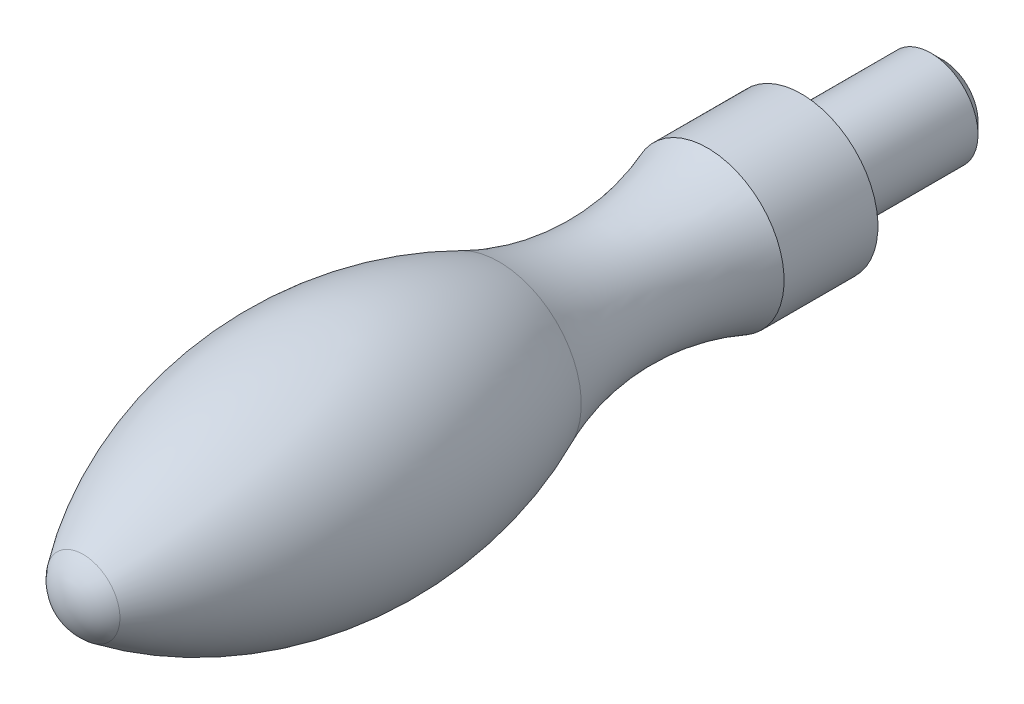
ISO-10303-21;
HEADER;
FILE_DESCRIPTION(('STEP AP214'),'2;1');
FILE_NAME('part.step','',(''),(''),'','','');
FILE_SCHEMA(('AUTOMOTIVE_DESIGN { 1 0 10303 214 1 1 1 1 }'));
ENDSEC;
DATA;
#1=APPLICATION_CONTEXT('core data for automotive mechanical design processes');
#2=APPLICATION_PROTOCOL_DEFINITION('international standard','automotive_design',2000,#1);
#3=PRODUCT_CONTEXT('',#1,'mechanical');
#4=PRODUCT('Part','Part','',(#3));
#5=PRODUCT_RELATED_PRODUCT_CATEGORY('part','',(#4));
#6=PRODUCT_DEFINITION_FORMATION('','',#4);
#7=PRODUCT_DEFINITION_CONTEXT('part definition',#1,'design');
#8=PRODUCT_DEFINITION('design','',#6,#7);
#9=PRODUCT_DEFINITION_SHAPE('','',#8);
#10=(LENGTH_UNIT() NAMED_UNIT(*) SI_UNIT(.MILLI.,.METRE.));
#11=(NAMED_UNIT(*) PLANE_ANGLE_UNIT() SI_UNIT($,.RADIAN.));
#12=(NAMED_UNIT(*) SI_UNIT($,.STERADIAN.) SOLID_ANGLE_UNIT());
#13=UNCERTAINTY_MEASURE_WITH_UNIT(LENGTH_MEASURE(1.E-05),#10,'distance_accuracy_value','');
#14=(GEOMETRIC_REPRESENTATION_CONTEXT(3) GLOBAL_UNCERTAINTY_ASSIGNED_CONTEXT((#13)) GLOBAL_UNIT_ASSIGNED_CONTEXT((#10,
#11,#12)) REPRESENTATION_CONTEXT('',''));
#15=CARTESIAN_POINT('',(0.,0.,0.));
#16=DIRECTION('',(0.,0.,1.));
#17=DIRECTION('',(1.,0.,0.));
#18=AXIS2_PLACEMENT_3D('',#15,#16,#17);
#19=CARTESIAN_POINT('',(0.,0.,-29.));
#20=DIRECTION('',(0.,0.,-1.));
#21=DIRECTION('',(-1.,0.,0.));
#22=AXIS2_PLACEMENT_3D('',#19,#20,#21);
#23=CYLINDRICAL_SURFACE('',#22,8.);
#24=CARTESIAN_POINT('',(0.,0.,-22.));
#25=DIRECTION('',(0.,0.,-1.));
#26=DIRECTION('',(-1.,0.,0.));
#27=AXIS2_PLACEMENT_3D('',#24,#25,#26);
#28=CIRCLE('',#27,8.);
#29=CARTESIAN_POINT('',(-8.,0.,-22.));
#30=VERTEX_POINT('',#29);
#31=EDGE_CURVE('E8',#30,#30,#28,.F.);
#32=ORIENTED_EDGE('',*,*,#31,.T.);
#33=EDGE_LOOP('',(#32));
#34=FACE_BOUND('',#33,.T.);
#35=CARTESIAN_POINT('',(0.,0.,0.));
#36=DIRECTION('',(0.,0.,-1.));
#37=DIRECTION('',(-1.,0.,0.));
#38=AXIS2_PLACEMENT_3D('',#35,#36,#37);
#39=CIRCLE('',#38,8.);
#40=CARTESIAN_POINT('',(-8.,0.,0.));
#41=VERTEX_POINT('',#40);
#42=EDGE_CURVE('E38',#41,#41,#39,.T.);
#43=ORIENTED_EDGE('',*,*,#42,.T.);
#44=EDGE_LOOP('',(#43));
#45=FACE_BOUND('',#44,.T.);
#46=ADVANCED_FACE('F12',(#34,#45),#23,.T.);
#47=CARTESIAN_POINT('',(0.,0.,-24.));
#48=DIRECTION('',(0.,0.,-1.));
#49=DIRECTION('',(-1.,0.,0.));
#50=AXIS2_PLACEMENT_3D('',#47,#48,#49);
#51=PLANE('',#50);
#52=CARTESIAN_POINT('',(0.,0.,-24.));
#53=DIRECTION('',(0.,0.,-1.));
#54=DIRECTION('',(-1.,0.,0.));
#55=AXIS2_PLACEMENT_3D('',#52,#53,#54);
#56=CIRCLE('',#55,6.);
#57=CARTESIAN_POINT('',(-6.,0.,-24.));
#58=VERTEX_POINT('',#57);
#59=EDGE_CURVE('E19',#58,#58,#56,.T.);
#60=ORIENTED_EDGE('',*,*,#59,.T.);
#61=EDGE_LOOP('',(#60));
#62=FACE_BOUND('',#61,.T.);
#63=ADVANCED_FACE('F59',(#62),#51,.T.);
#64=CARTESIAN_POINT('',(0.,0.,117.));
#65=DIRECTION('',(-1.,0.,0.));
#66=DIRECTION('',(0.,0.,1.));
#67=AXIS2_PLACEMENT_3D('',#64,#65,#66);
#68=SPHERICAL_SURFACE('',#67,8.);
#69=CARTESIAN_POINT('',(0.,0.,117.));
#70=DIRECTION('',(0.,0.,-1.));
#71=DIRECTION('',(-1.,0.,0.));
#72=AXIS2_PLACEMENT_3D('',#69,#70,#71);
#73=SPHERICAL_SURFACE('',#72,8.);
#74=CARTESIAN_POINT('',(0.,0.,121.998665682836));
#75=DIRECTION('',(0.,0.,-1.));
#76=DIRECTION('',(-1.,0.,0.));
#77=AXIS2_PLACEMENT_3D('',#74,#75,#76);
#78=CIRCLE('',#77,6.24606607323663);
#79=CARTESIAN_POINT('',(-6.24606607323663,0.,121.998665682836));
#80=VERTEX_POINT('',#79);
#81=EDGE_CURVE('E23',#80,#80,#78,.T.);
#82=ORIENTED_EDGE('',*,*,#81,.F.);
#83=EDGE_LOOP('',(#82));
#84=FACE_BOUND('',#83,.T.);
#85=ADVANCED_FACE('F64',(#84),#73,.T.);
#86=CARTESIAN_POINT('',(0.,0.,80.));
#87=DIRECTION('',(0.,0.,-1.));
#88=DIRECTION('',(-1.,0.,0.));
#89=AXIS2_PLACEMENT_3D('',#86,#87,#88);
#90=DEGENERATE_TOROIDAL_SURFACE('',#89,51.,71.,.F.);
#91=CARTESIAN_POINT('',(0.,0.,51.3494886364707));
#92=DIRECTION('',(0.,0.,-1.));
#93=DIRECTION('',(-1.,0.,0.));
#94=AXIS2_PLACEMENT_3D('',#91,#92,#93);
#95=CIRCLE('',#94,13.9626677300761);
#96=CARTESIAN_POINT('',(-13.9626677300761,0.,51.3494886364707));
#97=VERTEX_POINT('',#96);
#98=EDGE_CURVE('E27',#97,#97,#95,.T.);
#99=ORIENTED_EDGE('',*,*,#98,.F.);
#100=EDGE_LOOP('',(#99));
#101=FACE_BOUND('',#100,.T.);
#102=ORIENTED_EDGE('',*,*,#81,.T.);
#103=EDGE_LOOP('',(#102));
#104=FACE_BOUND('',#103,.T.);
#105=ADVANCED_FACE('F69',(#101,#104),#90,.F.);
#106=CARTESIAN_POINT('',(0.,0.,32.4661487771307));
#107=DIRECTION('',(0.,0.,-1.));
#108=DIRECTION('',(-1.,0.,0.));
#109=AXIS2_PLACEMENT_3D('',#106,#107,#108);
#110=TOROIDAL_SURFACE('',#109,56.7790809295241,46.7955741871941);
#111=ORIENTED_EDGE('',*,*,#98,.T.);
#112=EDGE_LOOP('',(#111));
#113=FACE_BOUND('',#112,.T.);
#114=CARTESIAN_POINT('',(0.,0.,15.9373764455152));
#115=DIRECTION('',(0.,0.,-1.));
#116=DIRECTION('',(-1.,0.,0.));
#117=AXIS2_PLACEMENT_3D('',#114,#115,#116);
#118=CIRCLE('',#117,12.9997998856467);
#119=CARTESIAN_POINT('',(-12.9997998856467,0.,15.9373764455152));
#120=VERTEX_POINT('',#119);
#121=EDGE_CURVE('E32',#120,#120,#118,.T.);
#122=ORIENTED_EDGE('',*,*,#121,.F.);
#123=EDGE_LOOP('',(#122));
#124=FACE_BOUND('',#123,.T.);
#125=ADVANCED_FACE('F55',(#113,#124),#110,.F.);
#126=CARTESIAN_POINT('',(0.,0.,-29.));
#127=DIRECTION('',(0.,0.,-1.));
#128=DIRECTION('',(-1.,0.,0.));
#129=AXIS2_PLACEMENT_3D('',#126,#127,#128);
#130=CYLINDRICAL_SURFACE('',#129,12.9997998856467);
#131=CARTESIAN_POINT('',(0.,0.,0.));
#132=DIRECTION('',(0.,0.,-1.));
#133=DIRECTION('',(-1.,0.,0.));
#134=AXIS2_PLACEMENT_3D('',#131,#132,#133);
#135=CIRCLE('',#134,12.9997998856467);
#136=CARTESIAN_POINT('',(-12.9997998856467,0.,0.));
#137=VERTEX_POINT('',#136);
#138=EDGE_CURVE('E35',#137,#137,#135,.T.);
#139=ORIENTED_EDGE('',*,*,#138,.F.);
#140=EDGE_LOOP('',(#139));
#141=FACE_BOUND('',#140,.T.);
#142=ORIENTED_EDGE('',*,*,#121,.T.);
#143=EDGE_LOOP('',(#142));
#144=FACE_BOUND('',#143,.T.);
#145=ADVANCED_FACE('F45',(#141,#144),#130,.T.);
#146=CARTESIAN_POINT('',(0.,8.,0.));
#147=DIRECTION('',(0.,0.,-1.));
#148=DIRECTION('',(-1.,0.,0.));
#149=AXIS2_PLACEMENT_3D('',#146,#147,#148);
#150=PLANE('',#149);
#151=ORIENTED_EDGE('',*,*,#138,.T.);
#152=EDGE_LOOP('',(#151));
#153=FACE_BOUND('',#152,.T.);
#154=ORIENTED_EDGE('',*,*,#42,.F.);
#155=EDGE_LOOP('',(#154));
#156=FACE_BOUND('',#155,.T.);
#157=ADVANCED_FACE('F43',(#153,#156),#150,.T.);
#158=CARTESIAN_POINT('',(0.,0.,-24.));
#159=DIRECTION('',(0.,0.,1.));
#160=DIRECTION('',(1.,0.,0.));
#161=AXIS2_PLACEMENT_3D('',#158,#159,#160);
#162=CONICAL_SURFACE('',#161,6.,0.785398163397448);
#163=ORIENTED_EDGE('',*,*,#31,.F.);
#164=EDGE_LOOP('',(#163));
#165=FACE_BOUND('',#164,.T.);
#166=ORIENTED_EDGE('',*,*,#59,.F.);
#167=EDGE_LOOP('',(#166));
#168=FACE_BOUND('',#167,.T.);
#169=ADVANCED_FACE('F14',(#165,#168),#162,.T.);
#170=CLOSED_SHELL('',(#46,#63,#85,#105,#125,#145,#157,#169));
#171=MANIFOLD_SOLID_BREP('B1',#170);
#172=ADVANCED_BREP_SHAPE_REPRESENTATION('',(#18,#171),#14);
#173=SHAPE_DEFINITION_REPRESENTATION(#9,#172);
ENDSEC;
END-ISO-10303-21;
